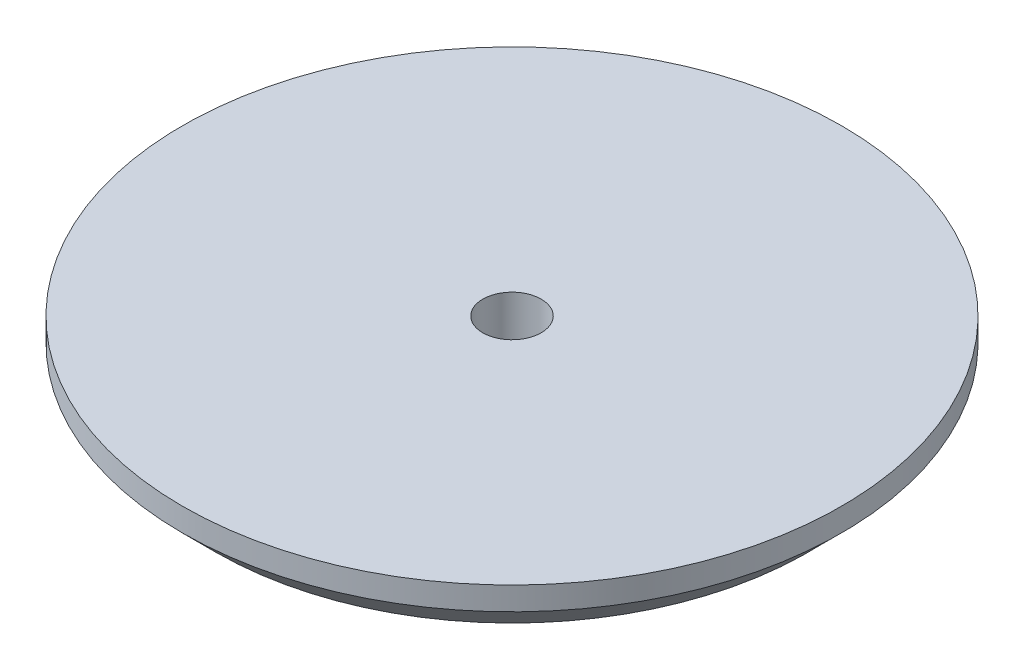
ISO-10303-21;
HEADER;
FILE_DESCRIPTION(('STEP AP214'),'2;1');
FILE_NAME('part.step','',(''),(''),'','','');
FILE_SCHEMA(('AUTOMOTIVE_DESIGN { 1 0 10303 214 1 1 1 1 }'));
ENDSEC;
DATA;
#1=APPLICATION_CONTEXT('core data for automotive mechanical design processes');
#2=APPLICATION_PROTOCOL_DEFINITION('international standard','automotive_design',2000,#1);
#3=PRODUCT_CONTEXT('',#1,'mechanical');
#4=PRODUCT('Part','Part','',(#3));
#5=PRODUCT_RELATED_PRODUCT_CATEGORY('part','',(#4));
#6=PRODUCT_DEFINITION_FORMATION('','',#4);
#7=PRODUCT_DEFINITION_CONTEXT('part definition',#1,'design');
#8=PRODUCT_DEFINITION('design','',#6,#7);
#9=PRODUCT_DEFINITION_SHAPE('','',#8);
#10=(LENGTH_UNIT() NAMED_UNIT(*) SI_UNIT(.MILLI.,.METRE.));
#11=(NAMED_UNIT(*) PLANE_ANGLE_UNIT() SI_UNIT($,.RADIAN.));
#12=(NAMED_UNIT(*) SI_UNIT($,.STERADIAN.) SOLID_ANGLE_UNIT());
#13=UNCERTAINTY_MEASURE_WITH_UNIT(LENGTH_MEASURE(1.E-05),#10,'distance_accuracy_value','');
#14=(GEOMETRIC_REPRESENTATION_CONTEXT(3) GLOBAL_UNCERTAINTY_ASSIGNED_CONTEXT((#13)) GLOBAL_UNIT_ASSIGNED_CONTEXT((#10,
#11,#12)) REPRESENTATION_CONTEXT('',''));
#15=CARTESIAN_POINT('',(0.,0.,0.));
#16=DIRECTION('',(0.,0.,1.));
#17=DIRECTION('',(1.,0.,0.));
#18=AXIS2_PLACEMENT_3D('',#15,#16,#17);
#19=CARTESIAN_POINT('',(0.,0.,0.));
#20=DIRECTION('',(0.,1.,0.));
#21=DIRECTION('',(0.,0.,1.));
#22=AXIS2_PLACEMENT_3D('',#19,#20,#21);
#23=PLANE('',#22);
#24=CARTESIAN_POINT('',(0.,0.,0.));
#25=DIRECTION('',(0.,1.,0.));
#26=DIRECTION('',(0.,0.,1.));
#27=AXIS2_PLACEMENT_3D('',#24,#25,#26);
#28=CIRCLE('',#27,3.1);
#29=CARTESIAN_POINT('',(0.,0.,3.1));
#30=VERTEX_POINT('',#29);
#31=EDGE_CURVE('E38',#30,#30,#28,.T.);
#32=ORIENTED_EDGE('',*,*,#31,.T.);
#33=EDGE_LOOP('',(#32));
#34=FACE_BOUND('',#33,.T.);
#35=CARTESIAN_POINT('',(0.,0.,0.));
#36=DIRECTION('',(0.,1.,0.));
#37=DIRECTION('',(0.,0.,1.));
#38=AXIS2_PLACEMENT_3D('',#35,#36,#37);
#39=CIRCLE('',#38,31.4644660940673);
#40=CARTESIAN_POINT('',(0.,0.,31.4644660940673));
#41=VERTEX_POINT('',#40);
#42=EDGE_CURVE('E10',#41,#41,#39,.T.);
#43=ORIENTED_EDGE('',*,*,#42,.F.);
#44=EDGE_LOOP('',(#43));
#45=FACE_BOUND('',#44,.T.);
#46=ADVANCED_FACE('F24',(#34,#45),#23,.F.);
#47=CARTESIAN_POINT('',(0.,0.,0.));
#48=DIRECTION('',(0.,1.,0.));
#49=DIRECTION('',(0.,0.,1.));
#50=AXIS2_PLACEMENT_3D('',#47,#48,#49);
#51=CONICAL_SURFACE('',#50,31.4644660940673,0.785398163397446);
#52=CARTESIAN_POINT('',(0.,3.53553390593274,0.));
#53=DIRECTION('',(0.,1.,0.));
#54=DIRECTION('',(0.,0.,1.));
#55=AXIS2_PLACEMENT_3D('',#52,#53,#54);
#56=CIRCLE('',#55,35.);
#57=CARTESIAN_POINT('',(0.,3.53553390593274,35.));
#58=VERTEX_POINT('',#57);
#59=EDGE_CURVE('E30',#58,#58,#56,.T.);
#60=ORIENTED_EDGE('',*,*,#59,.F.);
#61=EDGE_LOOP('',(#60));
#62=FACE_BOUND('',#61,.T.);
#63=ORIENTED_EDGE('',*,*,#42,.T.);
#64=EDGE_LOOP('',(#63));
#65=FACE_BOUND('',#64,.T.);
#66=ADVANCED_FACE('F57',(#62,#65),#51,.T.);
#67=CARTESIAN_POINT('',(0.,18.0759168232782,0.));
#68=DIRECTION('',(0.,1.,0.));
#69=DIRECTION('',(0.,0.,1.));
#70=AXIS2_PLACEMENT_3D('',#67,#68,#69);
#71=CYLINDRICAL_SURFACE('',#70,35.);
#72=CARTESIAN_POINT('',(0.,5.99999999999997,0.));
#73=DIRECTION('',(0.,1.,0.));
#74=DIRECTION('',(0.,0.,1.));
#75=AXIS2_PLACEMENT_3D('',#72,#73,#74);
#76=CIRCLE('',#75,35.);
#77=CARTESIAN_POINT('',(0.,5.99999999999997,35.));
#78=VERTEX_POINT('',#77);
#79=EDGE_CURVE('E34',#78,#78,#76,.T.);
#80=ORIENTED_EDGE('',*,*,#79,.F.);
#81=EDGE_LOOP('',(#80));
#82=FACE_BOUND('',#81,.T.);
#83=ORIENTED_EDGE('',*,*,#59,.T.);
#84=EDGE_LOOP('',(#83));
#85=FACE_BOUND('',#84,.T.);
#86=ADVANCED_FACE('F52',(#82,#85),#71,.T.);
#87=CARTESIAN_POINT('',(35.,5.9999999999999,0.));
#88=DIRECTION('',(0.,-1.,0.));
#89=DIRECTION('',(0.,0.,-1.));
#90=AXIS2_PLACEMENT_3D('',#87,#88,#89);
#91=PLANE('',#90);
#92=CARTESIAN_POINT('',(0.,5.9999999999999,0.));
#93=DIRECTION('',(0.,1.,0.));
#94=DIRECTION('',(0.,0.,1.));
#95=AXIS2_PLACEMENT_3D('',#92,#93,#94);
#96=CIRCLE('',#95,3.1);
#97=CARTESIAN_POINT('',(0.,5.9999999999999,3.1));
#98=VERTEX_POINT('',#97);
#99=EDGE_CURVE('E43',#98,#98,#96,.T.);
#100=ORIENTED_EDGE('',*,*,#99,.F.);
#101=EDGE_LOOP('',(#100));
#102=FACE_BOUND('',#101,.T.);
#103=ORIENTED_EDGE('',*,*,#79,.T.);
#104=EDGE_LOOP('',(#103));
#105=FACE_BOUND('',#104,.T.);
#106=ADVANCED_FACE('F49',(#102,#105),#91,.F.);
#107=CARTESIAN_POINT('',(0.,0.,0.));
#108=DIRECTION('',(0.,1.,0.));
#109=DIRECTION('',(0.,0.,1.));
#110=AXIS2_PLACEMENT_3D('',#107,#108,#109);
#111=CYLINDRICAL_SURFACE('',#110,3.1);
#112=ORIENTED_EDGE('',*,*,#31,.F.);
#113=EDGE_LOOP('',(#112));
#114=FACE_BOUND('',#113,.T.);
#115=ORIENTED_EDGE('',*,*,#99,.T.);
#116=EDGE_LOOP('',(#115));
#117=FACE_BOUND('',#116,.T.);
#118=ADVANCED_FACE('F47',(#114,#117),#111,.F.);
#119=CLOSED_SHELL('',(#46,#66,#86,#106,#118));
#120=MANIFOLD_SOLID_BREP('B2',#119);
#121=ADVANCED_BREP_SHAPE_REPRESENTATION('',(#18,#120),#14);
#122=SHAPE_DEFINITION_REPRESENTATION(#9,#121);
ENDSEC;
END-ISO-10303-21;
